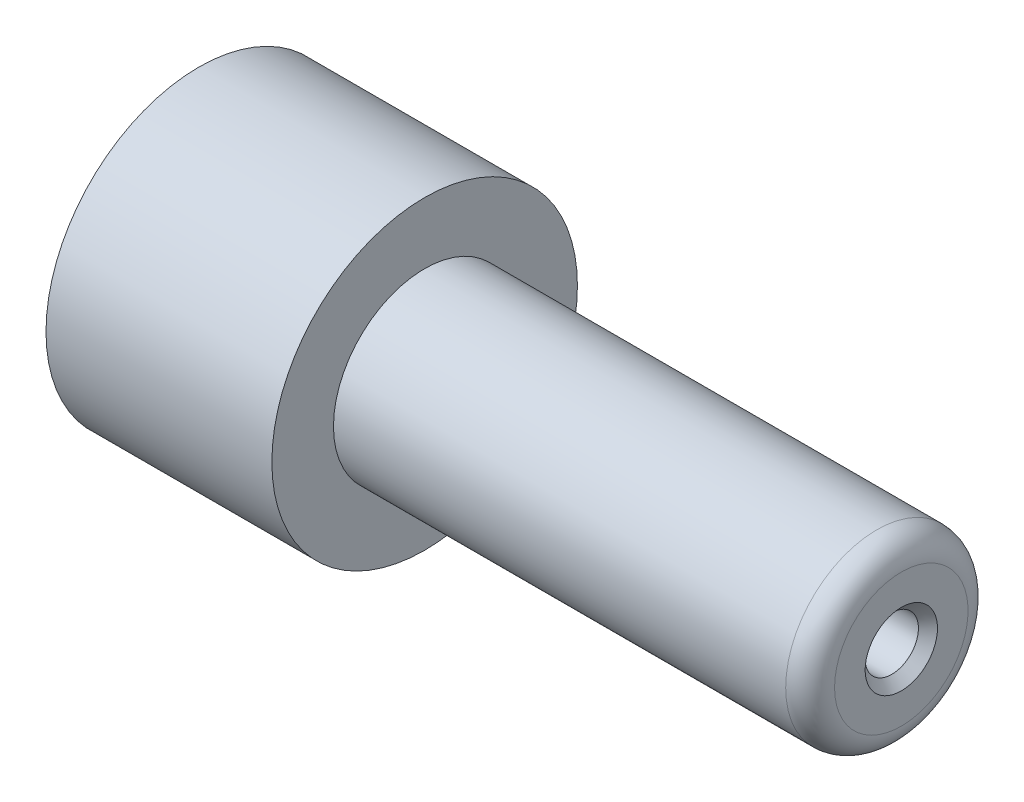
ISO-10303-21;
HEADER;
FILE_DESCRIPTION(('STEP AP214'),'2;1');
FILE_NAME('part.step','',(''),(''),'','','');
FILE_SCHEMA(('AUTOMOTIVE_DESIGN { 1 0 10303 214 1 1 1 1 }'));
ENDSEC;
DATA;
#1=APPLICATION_CONTEXT('core data for automotive mechanical design processes');
#2=APPLICATION_PROTOCOL_DEFINITION('international standard','automotive_design',2000,#1);
#3=PRODUCT_CONTEXT('',#1,'mechanical');
#4=PRODUCT('Part','Part','',(#3));
#5=PRODUCT_RELATED_PRODUCT_CATEGORY('part','',(#4));
#6=PRODUCT_DEFINITION_FORMATION('','',#4);
#7=PRODUCT_DEFINITION_CONTEXT('part definition',#1,'design');
#8=PRODUCT_DEFINITION('design','',#6,#7);
#9=PRODUCT_DEFINITION_SHAPE('','',#8);
#10=(LENGTH_UNIT() NAMED_UNIT(*) SI_UNIT(.MILLI.,.METRE.));
#11=(NAMED_UNIT(*) PLANE_ANGLE_UNIT() SI_UNIT($,.RADIAN.));
#12=(NAMED_UNIT(*) SI_UNIT($,.STERADIAN.) SOLID_ANGLE_UNIT());
#13=UNCERTAINTY_MEASURE_WITH_UNIT(LENGTH_MEASURE(1.E-05),#10,'distance_accuracy_value','');
#14=(GEOMETRIC_REPRESENTATION_CONTEXT(3) GLOBAL_UNCERTAINTY_ASSIGNED_CONTEXT((#13)) GLOBAL_UNIT_ASSIGNED_CONTEXT((#10,
#11,#12)) REPRESENTATION_CONTEXT('',''));
#15=CARTESIAN_POINT('',(0.,0.,0.));
#16=DIRECTION('',(0.,0.,1.));
#17=DIRECTION('',(1.,0.,0.));
#18=AXIS2_PLACEMENT_3D('',#15,#16,#17);
#19=CARTESIAN_POINT('',(0.,0.,0.));
#20=DIRECTION('',(-1.,0.,0.));
#21=DIRECTION('',(0.,0.,1.));
#22=AXIS2_PLACEMENT_3D('',#19,#20,#21);
#23=CYLINDRICAL_SURFACE('',#22,3.5687);
#24=CARTESIAN_POINT('',(24.4856,0.,0.));
#25=DIRECTION('',(-1.,0.,0.));
#26=DIRECTION('',(0.,0.,1.));
#27=AXIS2_PLACEMENT_3D('',#24,#25,#26);
#28=CIRCLE('',#27,3.5687);
#29=CARTESIAN_POINT('',(24.4856,0.,3.5687));
#30=VERTEX_POINT('',#29);
#31=EDGE_CURVE('E46',#30,#30,#28,.T.);
#32=ORIENTED_EDGE('',*,*,#31,.F.);
#33=EDGE_LOOP('',(#32));
#34=FACE_BOUND('',#33,.T.);
#35=CARTESIAN_POINT('',(0.,0.,0.));
#36=DIRECTION('',(-1.,0.,0.));
#37=DIRECTION('',(0.,0.,1.));
#38=AXIS2_PLACEMENT_3D('',#35,#36,#37);
#39=CIRCLE('',#38,3.5687);
#40=CARTESIAN_POINT('',(0.,0.,3.5687));
#41=VERTEX_POINT('',#40);
#42=EDGE_CURVE('E67',#41,#41,#39,.T.);
#43=ORIENTED_EDGE('',*,*,#42,.T.);
#44=EDGE_LOOP('',(#43));
#45=FACE_BOUND('',#44,.T.);
#46=ADVANCED_FACE('F35',(#34,#45),#23,.F.);
#47=CARTESIAN_POINT('',(24.4856,3.5687,0.));
#48=DIRECTION('',(1.,0.,0.));
#49=DIRECTION('',(0.,0.,-1.));
#50=AXIS2_PLACEMENT_3D('',#47,#48,#49);
#51=PLANE('',#50);
#52=ORIENTED_EDGE('',*,*,#31,.T.);
#53=EDGE_LOOP('',(#52));
#54=FACE_BOUND('',#53,.T.);
#55=ADVANCED_FACE('F101',(#54),#51,.F.);
#56=CARTESIAN_POINT('',(36.4998,3.4671,0.));
#57=DIRECTION('',(-1.,0.,0.));
#58=DIRECTION('',(0.,0.,1.));
#59=AXIS2_PLACEMENT_3D('',#56,#57,#58);
#60=PLANE('',#59);
#61=CARTESIAN_POINT('',(36.4998,0.,0.));
#62=DIRECTION('',(-1.,0.,0.));
#63=DIRECTION('',(0.,0.,1.));
#64=AXIS2_PLACEMENT_3D('',#61,#62,#63);
#65=CIRCLE('',#64,1.87960000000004);
#66=CARTESIAN_POINT('',(36.4998,0.,1.87960000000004));
#67=VERTEX_POINT('',#66);
#68=EDGE_CURVE('E10',#67,#67,#65,.T.);
#69=ORIENTED_EDGE('',*,*,#68,.T.);
#70=EDGE_LOOP('',(#69));
#71=FACE_BOUND('',#70,.T.);
#72=CARTESIAN_POINT('',(36.4998,0.,0.));
#73=DIRECTION('',(-1.,0.,0.));
#74=DIRECTION('',(0.,0.,1.));
#75=AXIS2_PLACEMENT_3D('',#72,#73,#74);
#76=CIRCLE('',#75,3.4671);
#77=CARTESIAN_POINT('',(36.4998,0.,3.4671));
#78=VERTEX_POINT('',#77);
#79=EDGE_CURVE('E50',#78,#78,#76,.T.);
#80=ORIENTED_EDGE('',*,*,#79,.F.);
#81=EDGE_LOOP('',(#80));
#82=FACE_BOUND('',#81,.T.);
#83=ADVANCED_FACE('F106',(#71,#82),#60,.F.);
#84=CARTESIAN_POINT('',(35.2298,0.,0.));
#85=DIRECTION('',(-1.,0.,0.));
#86=DIRECTION('',(0.,0.,1.));
#87=AXIS2_PLACEMENT_3D('',#84,#85,#86);
#88=TOROIDAL_SURFACE('',#87,3.4671,1.27);
#89=CARTESIAN_POINT('',(35.2298,0.,0.));
#90=DIRECTION('',(-1.,0.,0.));
#91=DIRECTION('',(0.,0.,1.));
#92=AXIS2_PLACEMENT_3D('',#89,#90,#91);
#93=CIRCLE('',#92,4.7371);
#94=CARTESIAN_POINT('',(35.2298,0.,4.7371));
#95=VERTEX_POINT('',#94);
#96=EDGE_CURVE('E55',#95,#95,#93,.T.);
#97=ORIENTED_EDGE('',*,*,#96,.F.);
#98=EDGE_LOOP('',(#97));
#99=FACE_BOUND('',#98,.T.);
#100=ORIENTED_EDGE('',*,*,#79,.T.);
#101=EDGE_LOOP('',(#100));
#102=FACE_BOUND('',#101,.T.);
#103=ADVANCED_FACE('F114',(#99,#102),#88,.T.);
#104=CARTESIAN_POINT('',(0.,0.,0.));
#105=DIRECTION('',(-1.,0.,0.));
#106=DIRECTION('',(0.,0.,1.));
#107=AXIS2_PLACEMENT_3D('',#104,#105,#106);
#108=CYLINDRICAL_SURFACE('',#107,4.7371);
#109=CARTESIAN_POINT('',(11.7348,0.,0.));
#110=DIRECTION('',(-1.,0.,0.));
#111=DIRECTION('',(0.,0.,1.));
#112=AXIS2_PLACEMENT_3D('',#109,#110,#111);
#113=CIRCLE('',#112,4.7371);
#114=CARTESIAN_POINT('',(11.7348,0.,4.7371));
#115=VERTEX_POINT('',#114);
#116=EDGE_CURVE('E58',#115,#115,#113,.T.);
#117=ORIENTED_EDGE('',*,*,#116,.F.);
#118=EDGE_LOOP('',(#117));
#119=FACE_BOUND('',#118,.T.);
#120=ORIENTED_EDGE('',*,*,#96,.T.);
#121=EDGE_LOOP('',(#120));
#122=FACE_BOUND('',#121,.T.);
#123=ADVANCED_FACE('F117',(#119,#122),#108,.T.);
#124=CARTESIAN_POINT('',(11.7348,7.9375,0.));
#125=DIRECTION('',(-1.,0.,0.));
#126=DIRECTION('',(0.,0.,1.));
#127=AXIS2_PLACEMENT_3D('',#124,#125,#126);
#128=PLANE('',#127);
#129=CARTESIAN_POINT('',(11.7348,0.,0.));
#130=DIRECTION('',(-1.,0.,0.));
#131=DIRECTION('',(0.,0.,1.));
#132=AXIS2_PLACEMENT_3D('',#129,#130,#131);
#133=CIRCLE('',#132,7.9375);
#134=CARTESIAN_POINT('',(11.7348,0.,7.9375));
#135=VERTEX_POINT('',#134);
#136=EDGE_CURVE('E61',#135,#135,#133,.T.);
#137=ORIENTED_EDGE('',*,*,#136,.F.);
#138=EDGE_LOOP('',(#137));
#139=FACE_BOUND('',#138,.T.);
#140=ORIENTED_EDGE('',*,*,#116,.T.);
#141=EDGE_LOOP('',(#140));
#142=FACE_BOUND('',#141,.T.);
#143=ADVANCED_FACE('F121',(#139,#142),#128,.F.);
#144=CARTESIAN_POINT('',(0.,0.,0.));
#145=DIRECTION('',(-1.,0.,0.));
#146=DIRECTION('',(0.,0.,1.));
#147=AXIS2_PLACEMENT_3D('',#144,#145,#146);
#148=CYLINDRICAL_SURFACE('',#147,7.9375);
#149=CARTESIAN_POINT('',(0.,0.,0.));
#150=DIRECTION('',(-1.,0.,0.));
#151=DIRECTION('',(0.,0.,1.));
#152=AXIS2_PLACEMENT_3D('',#149,#150,#151);
#153=CIRCLE('',#152,7.9375);
#154=CARTESIAN_POINT('',(0.,0.,7.9375));
#155=VERTEX_POINT('',#154);
#156=EDGE_CURVE('E64',#155,#155,#153,.T.);
#157=ORIENTED_EDGE('',*,*,#156,.F.);
#158=EDGE_LOOP('',(#157));
#159=FACE_BOUND('',#158,.T.);
#160=ORIENTED_EDGE('',*,*,#136,.T.);
#161=EDGE_LOOP('',(#160));
#162=FACE_BOUND('',#161,.T.);
#163=ADVANCED_FACE('F125',(#159,#162),#148,.T.);
#164=CARTESIAN_POINT('',(0.,3.5687,0.));
#165=DIRECTION('',(1.,0.,0.));
#166=DIRECTION('',(0.,0.,-1.));
#167=AXIS2_PLACEMENT_3D('',#164,#165,#166);
#168=PLANE('',#167);
#169=CARTESIAN_POINT('',(0.,-5.5499,0.));
#170=DIRECTION('',(-1.,0.,0.));
#171=DIRECTION('',(0.,0.,-1.));
#172=AXIS2_PLACEMENT_3D('',#169,#170,#171);
#173=CIRCLE('',#172,1.1811);
#174=CARTESIAN_POINT('',(0.,-5.5499,-1.1811));
#175=VERTEX_POINT('',#174);
#176=EDGE_CURVE('E77',#175,#175,#173,.T.);
#177=ORIENTED_EDGE('',*,*,#176,.F.);
#178=EDGE_LOOP('',(#177));
#179=FACE_BOUND('',#178,.T.);
#180=CARTESIAN_POINT('',(0.,5.5499,0.));
#181=DIRECTION('',(-1.,0.,0.));
#182=DIRECTION('',(0.,0.,1.));
#183=AXIS2_PLACEMENT_3D('',#180,#181,#182);
#184=CIRCLE('',#183,1.1811);
#185=CARTESIAN_POINT('',(0.,5.5499,1.1811));
#186=VERTEX_POINT('',#185);
#187=EDGE_CURVE('E71',#186,#186,#184,.T.);
#188=ORIENTED_EDGE('',*,*,#187,.F.);
#189=EDGE_LOOP('',(#188));
#190=FACE_BOUND('',#189,.T.);
#191=ORIENTED_EDGE('',*,*,#42,.F.);
#192=EDGE_LOOP('',(#191));
#193=FACE_BOUND('',#192,.T.);
#194=ORIENTED_EDGE('',*,*,#156,.T.);
#195=EDGE_LOOP('',(#194));
#196=FACE_BOUND('',#195,.T.);
#197=ADVANCED_FACE('F129',(#179,#190,#193,#196),#168,.F.);
#198=CARTESIAN_POINT('',(2.3876,5.5499,0.));
#199=DIRECTION('',(-1.,0.,0.));
#200=DIRECTION('',(0.,0.,1.));
#201=AXIS2_PLACEMENT_3D('',#198,#199,#200);
#202=CYLINDRICAL_SURFACE('',#201,1.1811);
#203=CARTESIAN_POINT('',(2.3876,5.5499,0.));
#204=DIRECTION('',(-1.,0.,0.));
#205=DIRECTION('',(0.,0.,1.));
#206=AXIS2_PLACEMENT_3D('',#203,#204,#205);
#207=CIRCLE('',#206,1.1811);
#208=CARTESIAN_POINT('',(2.3876,5.5499,1.1811));
#209=VERTEX_POINT('',#208);
#210=EDGE_CURVE('E70',#209,#209,#207,.T.);
#211=ORIENTED_EDGE('',*,*,#210,.F.);
#212=EDGE_LOOP('',(#211));
#213=FACE_BOUND('',#212,.T.);
#214=ORIENTED_EDGE('',*,*,#187,.T.);
#215=EDGE_LOOP('',(#214));
#216=FACE_BOUND('',#215,.T.);
#217=ADVANCED_FACE('F133',(#213,#216),#202,.F.);
#218=CARTESIAN_POINT('',(2.3876,5.5499,0.));
#219=DIRECTION('',(-1.,0.,0.));
#220=DIRECTION('',(0.,0.,1.));
#221=AXIS2_PLACEMENT_3D('',#218,#219,#220);
#222=PLANE('',#221);
#223=ORIENTED_EDGE('',*,*,#210,.T.);
#224=EDGE_LOOP('',(#223));
#225=FACE_BOUND('',#224,.T.);
#226=ADVANCED_FACE('F137',(#225),#222,.T.);
#227=CARTESIAN_POINT('',(2.3876,-5.5499,0.));
#228=DIRECTION('',(-1.,0.,0.));
#229=DIRECTION('',(0.,0.,1.));
#230=AXIS2_PLACEMENT_3D('',#227,#228,#229);
#231=CYLINDRICAL_SURFACE('',#230,1.1811);
#232=CARTESIAN_POINT('',(2.3876,-5.5499,0.));
#233=DIRECTION('',(-1.,0.,0.));
#234=DIRECTION('',(0.,0.,-1.));
#235=AXIS2_PLACEMENT_3D('',#232,#233,#234);
#236=CIRCLE('',#235,1.1811);
#237=CARTESIAN_POINT('',(2.3876,-5.5499,-1.1811));
#238=VERTEX_POINT('',#237);
#239=EDGE_CURVE('E74',#238,#238,#236,.T.);
#240=ORIENTED_EDGE('',*,*,#239,.F.);
#241=EDGE_LOOP('',(#240));
#242=FACE_BOUND('',#241,.T.);
#243=ORIENTED_EDGE('',*,*,#176,.T.);
#244=EDGE_LOOP('',(#243));
#245=FACE_BOUND('',#244,.T.);
#246=ADVANCED_FACE('F97',(#242,#245),#231,.F.);
#247=CARTESIAN_POINT('',(2.3876,-5.5499,0.));
#248=DIRECTION('',(1.,0.,0.));
#249=DIRECTION('',(0.,0.,-1.));
#250=AXIS2_PLACEMENT_3D('',#247,#248,#249);
#251=PLANE('',#250);
#252=ORIENTED_EDGE('',*,*,#239,.T.);
#253=EDGE_LOOP('',(#252));
#254=FACE_BOUND('',#253,.T.);
#255=ADVANCED_FACE('F90',(#254),#251,.F.);
#256=CARTESIAN_POINT('',(26.9748,0.,0.));
#257=DIRECTION('',(1.,0.,0.));
#258=DIRECTION('',(0.,0.,-1.));
#259=AXIS2_PLACEMENT_3D('',#256,#257,#258);
#260=CYLINDRICAL_SURFACE('',#259,1.3843);
#261=CARTESIAN_POINT('',(36.0045,0.,0.));
#262=DIRECTION('',(-1.,0.,0.));
#263=DIRECTION('',(0.,0.,1.));
#264=AXIS2_PLACEMENT_3D('',#261,#262,#263);
#265=CIRCLE('',#264,1.3843);
#266=CARTESIAN_POINT('',(36.0045,0.,-1.3843));
#267=VERTEX_POINT('',#266);
#268=EDGE_CURVE('E42',#267,#267,#265,.F.);
#269=CARTESIAN_POINT('',(26.9748,0.,0.));
#270=DIRECTION('',(1.,0.,0.));
#271=DIRECTION('',(0.,0.,-1.));
#272=AXIS2_PLACEMENT_3D('',#269,#270,#271);
#273=CIRCLE('',#272,1.3843);
#274=CARTESIAN_POINT('',(26.9748,0.,-1.3843));
#275=VERTEX_POINT('',#274);
#276=EDGE_CURVE('E80',#275,#275,#273,.T.);
#277=CARTESIAN_POINT('',(36.0045,0.,-1.3843));
#278=CARTESIAN_POINT('',(35.910440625,0.,-1.3843));
#279=CARTESIAN_POINT('',(35.81638125,0.,-1.3843));
#280=CARTESIAN_POINT('',(35.6282625,0.,-1.3843));
#281=CARTESIAN_POINT('',(35.534203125,0.,-1.3843));
#282=CARTESIAN_POINT('',(35.346084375,0.,-1.3843));
#283=CARTESIAN_POINT('',(35.252025,0.,-1.3843));
#284=CARTESIAN_POINT('',(35.06390625,0.,-1.3843));
#285=CARTESIAN_POINT('',(34.969846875,0.,-1.3843));
#286=CARTESIAN_POINT('',(34.781728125,0.,-1.3843));
#287=CARTESIAN_POINT('',(34.68766875,0.,-1.3843));
#288=CARTESIAN_POINT('',(34.49955,0.,-1.3843));
#289=CARTESIAN_POINT('',(34.405490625,0.,-1.3843));
#290=CARTESIAN_POINT('',(34.217371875,0.,-1.3843));
#291=CARTESIAN_POINT('',(34.1233125,0.,-1.3843));
#292=CARTESIAN_POINT('',(33.93519375,0.,-1.3843));
#293=CARTESIAN_POINT('',(33.841134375,0.,-1.3843));
#294=CARTESIAN_POINT('',(33.653015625,0.,-1.3843));
#295=CARTESIAN_POINT('',(33.55895625,0.,-1.3843));
#296=CARTESIAN_POINT('',(33.3708375,0.,-1.3843));
#297=CARTESIAN_POINT('',(33.276778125,0.,-1.3843));
#298=CARTESIAN_POINT('',(33.088659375,0.,-1.3843));
#299=CARTESIAN_POINT('',(32.9946,0.,-1.3843));
#300=CARTESIAN_POINT('',(32.80648125,0.,-1.3843));
#301=CARTESIAN_POINT('',(32.712421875,0.,-1.3843));
#302=CARTESIAN_POINT('',(32.524303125,0.,-1.3843));
#303=CARTESIAN_POINT('',(32.43024375,0.,-1.3843));
#304=CARTESIAN_POINT('',(32.242125,0.,-1.3843));
#305=CARTESIAN_POINT('',(32.148065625,0.,-1.3843));
#306=CARTESIAN_POINT('',(31.959946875,0.,-1.3843));
#307=CARTESIAN_POINT('',(31.8658875,0.,-1.3843));
#308=CARTESIAN_POINT('',(31.67776875,0.,-1.3843));
#309=CARTESIAN_POINT('',(31.583709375,0.,-1.3843));
#310=CARTESIAN_POINT('',(31.395590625,0.,-1.3843));
#311=CARTESIAN_POINT('',(31.30153125,0.,-1.3843));
#312=CARTESIAN_POINT('',(31.1134125,0.,-1.3843));
#313=CARTESIAN_POINT('',(31.019353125,0.,-1.3843));
#314=CARTESIAN_POINT('',(30.831234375,0.,-1.3843));
#315=CARTESIAN_POINT('',(30.737175,0.,-1.3843));
#316=CARTESIAN_POINT('',(30.54905625,0.,-1.3843));
#317=CARTESIAN_POINT('',(30.454996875,0.,-1.3843));
#318=CARTESIAN_POINT('',(30.266878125,0.,-1.3843));
#319=CARTESIAN_POINT('',(30.17281875,0.,-1.3843));
#320=CARTESIAN_POINT('',(29.9847,0.,-1.3843));
#321=CARTESIAN_POINT('',(29.890640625,0.,-1.3843));
#322=CARTESIAN_POINT('',(29.702521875,0.,-1.3843));
#323=CARTESIAN_POINT('',(29.6084625,0.,-1.3843));
#324=CARTESIAN_POINT('',(29.42034375,0.,-1.3843));
#325=CARTESIAN_POINT('',(29.326284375,0.,-1.3843));
#326=CARTESIAN_POINT('',(29.138165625,0.,-1.3843));
#327=CARTESIAN_POINT('',(29.04410625,0.,-1.3843));
#328=CARTESIAN_POINT('',(28.8559875,0.,-1.3843));
#329=CARTESIAN_POINT('',(28.761928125,0.,-1.3843));
#330=CARTESIAN_POINT('',(28.573809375,0.,-1.3843));
#331=CARTESIAN_POINT('',(28.47975,0.,-1.3843));
#332=CARTESIAN_POINT('',(28.29163125,0.,-1.3843));
#333=CARTESIAN_POINT('',(28.197571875,0.,-1.3843));
#334=CARTESIAN_POINT('',(28.009453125,0.,-1.3843));
#335=CARTESIAN_POINT('',(27.91539375,0.,-1.3843));
#336=CARTESIAN_POINT('',(27.727275,0.,-1.3843));
#337=CARTESIAN_POINT('',(27.633215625,0.,-1.3843));
#338=CARTESIAN_POINT('',(27.445096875,0.,-1.3843));
#339=CARTESIAN_POINT('',(27.3510375,0.,-1.3843));
#340=CARTESIAN_POINT('',(27.16291875,0.,-1.3843));
#341=CARTESIAN_POINT('',(27.068859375,0.,-1.3843));
#342=CARTESIAN_POINT('',(26.9748,0.,-1.3843));
#343=B_SPLINE_CURVE_WITH_KNOTS('',3,(#277,#278,#279,#280,#281,#282,#283,#284,#285,#286,#287,
#288,#289,#290,#291,#292,#293,#294,#295,#296,#297,#298,#299,#300,#301,#302,#303,#304,#305,#306,
#307,#308,#309,#310,#311,#312,#313,#314,#315,#316,#317,#318,#319,#320,#321,#322,#323,#324,#325,
#326,#327,#328,#329,#330,#331,#332,#333,#334,#335,#336,#337,#338,#339,#340,#341,#342),
.UNSPECIFIED.,.F.,.F.,(4,2,2,2,2,2,2,2,2,2,2,2,2,2,2,2,2,2,2,2,2,2,2,2,2,2,2,2,2,2,2,2,4),(0.,
0.282178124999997,0.564356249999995,0.846534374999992,1.1287125,1.41089062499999,
1.69306874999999,1.97524687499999,2.25742499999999,2.53960312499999,2.82178124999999,
3.10395937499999,3.38613749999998,3.66831562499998,3.95049374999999,4.23267187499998,
4.51484999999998,4.79702812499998,5.07920624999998,5.36138437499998,5.64356249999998,
5.92574062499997,6.20791874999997,6.49009687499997,6.77227499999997,7.05445312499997,
7.33663124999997,7.61880937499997,7.90098749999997,8.18316562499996,8.46534374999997,
8.74752187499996,9.02969999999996),.UNSPECIFIED.);
#344=EDGE_CURVE('BSEAM88',#267,#275,#343,.T.);
#345=ORIENTED_EDGE('',*,*,#268,.T.);
#346=ORIENTED_EDGE('',*,*,#276,.F.);
#347=ORIENTED_EDGE('',*,*,#344,.T.);
#348=ORIENTED_EDGE('',*,*,#344,.F.);
#349=EDGE_LOOP('',(#345,#347,#346,#348));
#350=FACE_BOUND('',#349,.T.);
#351=ADVANCED_FACE('F88',(#350),#260,.F.);
#352=CARTESIAN_POINT('',(26.9748,0.,0.));
#353=DIRECTION('',(1.,0.,0.));
#354=DIRECTION('',(0.,0.,-1.));
#355=AXIS2_PLACEMENT_3D('',#352,#353,#354);
#356=PLANE('',#355);
#357=ORIENTED_EDGE('',*,*,#276,.T.);
#358=EDGE_LOOP('',(#357));
#359=FACE_BOUND('',#358,.T.);
#360=ADVANCED_FACE('F86',(#359),#356,.T.);
#361=CARTESIAN_POINT('',(36.0045,0.,0.));
#362=DIRECTION('',(1.,0.,0.));
#363=DIRECTION('',(0.,0.,-1.));
#364=AXIS2_PLACEMENT_3D('',#361,#362,#363);
#365=CONICAL_SURFACE('',#364,1.3843,0.78539816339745);
#366=ORIENTED_EDGE('',*,*,#68,.F.);
#367=EDGE_LOOP('',(#366));
#368=FACE_BOUND('',#367,.T.);
#369=ORIENTED_EDGE('',*,*,#268,.F.);
#370=EDGE_LOOP('',(#369));
#371=FACE_BOUND('',#370,.T.);
#372=ADVANCED_FACE('F37',(#368,#371),#365,.F.);
#373=CLOSED_SHELL('',(#46,#55,#83,#103,#123,#143,#163,#197,#217,#226,#246,#255,#351,#360,#372));
#374=MANIFOLD_SOLID_BREP('B2',#373);
#375=ADVANCED_BREP_SHAPE_REPRESENTATION('',(#18,#374),#14);
#376=SHAPE_DEFINITION_REPRESENTATION(#9,#375);
ENDSEC;
END-ISO-10303-21;
